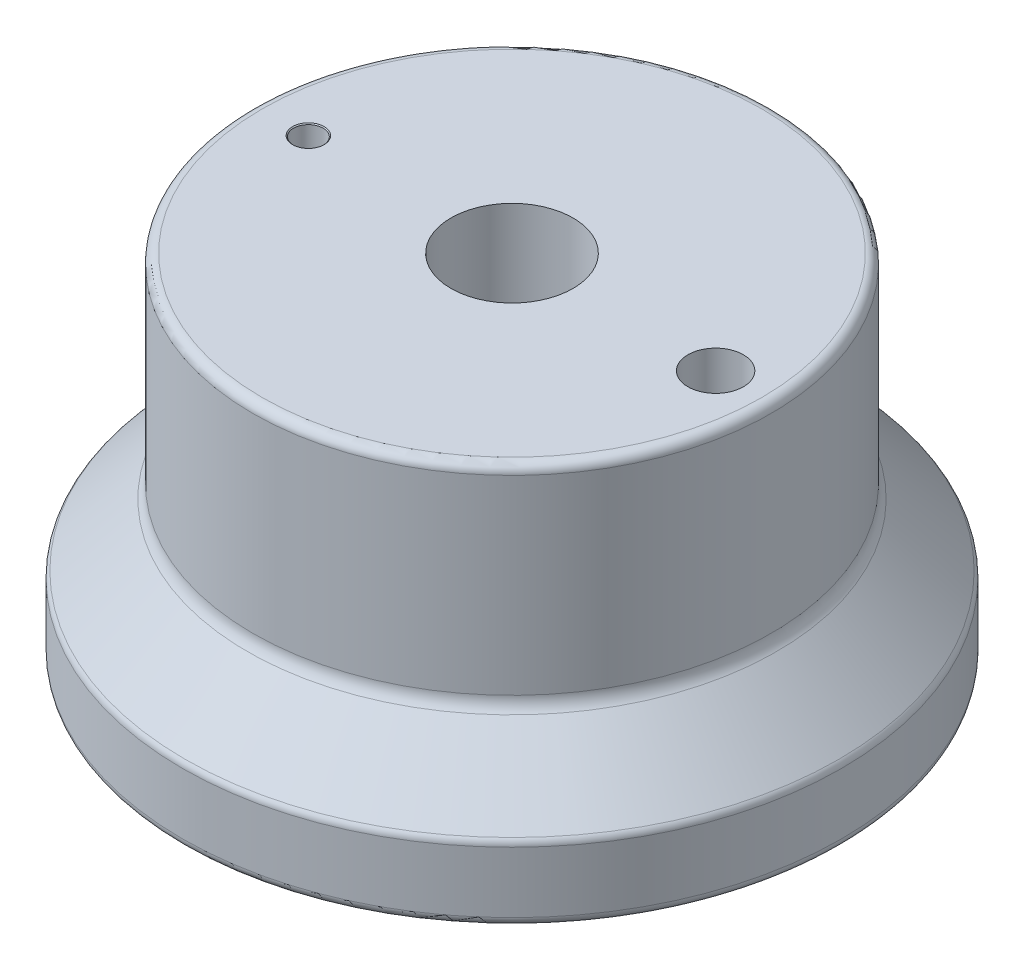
ISO-10303-21;
HEADER;
FILE_DESCRIPTION(('STEP AP214'),'2;1');
FILE_NAME('part.step','',(''),(''),'','','');
FILE_SCHEMA(('AUTOMOTIVE_DESIGN { 1 0 10303 214 1 1 1 1 }'));
ENDSEC;
DATA;
#1=APPLICATION_CONTEXT('core data for automotive mechanical design processes');
#2=APPLICATION_PROTOCOL_DEFINITION('international standard','automotive_design',2000,#1);
#3=PRODUCT_CONTEXT('',#1,'mechanical');
#4=PRODUCT('Part','Part','',(#3));
#5=PRODUCT_RELATED_PRODUCT_CATEGORY('part','',(#4));
#6=PRODUCT_DEFINITION_FORMATION('','',#4);
#7=PRODUCT_DEFINITION_CONTEXT('part definition',#1,'design');
#8=PRODUCT_DEFINITION('design','',#6,#7);
#9=PRODUCT_DEFINITION_SHAPE('','',#8);
#10=(LENGTH_UNIT() NAMED_UNIT(*) SI_UNIT(.MILLI.,.METRE.));
#11=(NAMED_UNIT(*) PLANE_ANGLE_UNIT() SI_UNIT($,.RADIAN.));
#12=(NAMED_UNIT(*) SI_UNIT($,.STERADIAN.) SOLID_ANGLE_UNIT());
#13=UNCERTAINTY_MEASURE_WITH_UNIT(LENGTH_MEASURE(1.E-05),#10,'distance_accuracy_value','');
#14=(GEOMETRIC_REPRESENTATION_CONTEXT(3) GLOBAL_UNCERTAINTY_ASSIGNED_CONTEXT((#13)) GLOBAL_UNIT_ASSIGNED_CONTEXT((#10,
#11,#12)) REPRESENTATION_CONTEXT('',''));
#15=CARTESIAN_POINT('',(0.,0.,0.));
#16=DIRECTION('',(0.,0.,1.));
#17=DIRECTION('',(1.,0.,0.));
#18=AXIS2_PLACEMENT_3D('',#15,#16,#17);
#19=CARTESIAN_POINT('',(8.9,0.,0.));
#20=DIRECTION('',(0.,-1.,0.));
#21=DIRECTION('',(0.,0.,-1.));
#22=AXIS2_PLACEMENT_3D('',#19,#20,#21);
#23=PLANE('',#22);
#24=CARTESIAN_POINT('',(0.,0.,0.));
#25=DIRECTION('',(0.,-1.,0.));
#26=DIRECTION('',(0.,0.,-1.));
#27=AXIS2_PLACEMENT_3D('',#24,#25,#26);
#28=CIRCLE('',#27,8.65);
#29=CARTESIAN_POINT('',(0.,0.,-8.65));
#30=VERTEX_POINT('',#29);
#31=EDGE_CURVE('E81',#30,#30,#28,.T.);
#32=ORIENTED_EDGE('',*,*,#31,.T.);
#33=EDGE_LOOP('',(#32));
#34=FACE_BOUND('',#33,.T.);
#35=CARTESIAN_POINT('',(-5.5,0.,0.));
#36=DIRECTION('',(0.,-1.,0.));
#37=DIRECTION('',(0.,0.,-1.));
#38=AXIS2_PLACEMENT_3D('',#35,#36,#37);
#39=CIRCLE('',#38,0.425);
#40=CARTESIAN_POINT('',(-5.5,0.,-0.425000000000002));
#41=VERTEX_POINT('',#40);
#42=EDGE_CURVE('E72',#41,#41,#39,.T.);
#43=ORIENTED_EDGE('',*,*,#42,.F.);
#44=EDGE_LOOP('',(#43));
#45=FACE_BOUND('',#44,.T.);
#46=ADVANCED_FACE('F35',(#34,#45),#23,.T.);
#47=CARTESIAN_POINT('',(0.,9.5,0.));
#48=DIRECTION('',(0.,1.,0.));
#49=DIRECTION('',(0.,0.,1.));
#50=AXIS2_PLACEMENT_3D('',#47,#48,#49);
#51=PLANE('',#50);
#52=CARTESIAN_POINT('',(5.5,9.5,0.));
#53=DIRECTION('',(0.,1.,0.));
#54=DIRECTION('',(0.,0.,1.));
#55=AXIS2_PLACEMENT_3D('',#52,#53,#54);
#56=CIRCLE('',#55,0.75);
#57=CARTESIAN_POINT('',(5.5,9.5,0.75));
#58=VERTEX_POINT('',#57);
#59=EDGE_CURVE('E59',#58,#58,#56,.T.);
#60=ORIENTED_EDGE('',*,*,#59,.F.);
#61=EDGE_LOOP('',(#60));
#62=FACE_BOUND('',#61,.T.);
#63=CARTESIAN_POINT('',(0.,9.5,0.));
#64=DIRECTION('',(0.,1.,0.));
#65=DIRECTION('',(0.,0.,1.));
#66=AXIS2_PLACEMENT_3D('',#63,#64,#65);
#67=CIRCLE('',#66,6.75);
#68=CARTESIAN_POINT('',(0.,9.5,6.75));
#69=VERTEX_POINT('',#68);
#70=EDGE_CURVE('E96',#69,#69,#67,.T.);
#71=ORIENTED_EDGE('',*,*,#70,.T.);
#72=EDGE_LOOP('',(#71));
#73=FACE_BOUND('',#72,.T.);
#74=CARTESIAN_POINT('',(0.,9.5,0.));
#75=DIRECTION('',(0.,1.,0.));
#76=DIRECTION('',(0.,0.,1.));
#77=AXIS2_PLACEMENT_3D('',#74,#75,#76);
#78=CIRCLE('',#77,1.65);
#79=CARTESIAN_POINT('',(0.,9.5,1.65));
#80=VERTEX_POINT('',#79);
#81=EDGE_CURVE('E58',#80,#80,#78,.T.);
#82=ORIENTED_EDGE('',*,*,#81,.F.);
#83=EDGE_LOOP('',(#82));
#84=FACE_BOUND('',#83,.T.);
#85=CARTESIAN_POINT('',(-5.5,9.5,0.));
#86=DIRECTION('',(0.,-1.,0.));
#87=DIRECTION('',(0.,0.,-1.));
#88=AXIS2_PLACEMENT_3D('',#85,#86,#87);
#89=CIRCLE('',#88,0.424999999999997);
#90=CARTESIAN_POINT('',(-5.5,9.5,-0.424999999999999));
#91=VERTEX_POINT('',#90);
#92=EDGE_CURVE('E69',#91,#91,#89,.T.);
#93=ORIENTED_EDGE('',*,*,#92,.T.);
#94=EDGE_LOOP('',(#93));
#95=FACE_BOUND('',#94,.T.);
#96=ADVANCED_FACE('F114',(#62,#73,#84,#95),#51,.T.);
#97=CARTESIAN_POINT('',(0.,0.,0.));
#98=DIRECTION('',(0.,-1.,0.));
#99=DIRECTION('',(0.,0.,-1.));
#100=AXIS2_PLACEMENT_3D('',#97,#98,#99);
#101=CYLINDRICAL_SURFACE('',#100,7.);
#102=CARTESIAN_POINT('',(0.,4.10710678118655,0.));
#103=DIRECTION('',(0.,-1.,0.));
#104=DIRECTION('',(0.,0.,-1.));
#105=AXIS2_PLACEMENT_3D('',#102,#103,#104);
#106=CIRCLE('',#105,7.);
#107=CARTESIAN_POINT('',(0.,4.10710678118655,-7.));
#108=VERTEX_POINT('',#107);
#109=EDGE_CURVE('E11',#108,#108,#106,.F.);
#110=ORIENTED_EDGE('',*,*,#109,.T.);
#111=EDGE_LOOP('',(#110));
#112=FACE_BOUND('',#111,.T.);
#113=CARTESIAN_POINT('',(0.,9.25,0.));
#114=DIRECTION('',(0.,1.,0.));
#115=DIRECTION('',(0.,0.,1.));
#116=AXIS2_PLACEMENT_3D('',#113,#114,#115);
#117=CIRCLE('',#116,7.);
#118=CARTESIAN_POINT('',(0.,9.25,7.));
#119=VERTEX_POINT('',#118);
#120=EDGE_CURVE('E93',#119,#119,#117,.F.);
#121=ORIENTED_EDGE('',*,*,#120,.T.);
#122=EDGE_LOOP('',(#121));
#123=FACE_BOUND('',#122,.T.);
#124=ADVANCED_FACE('F120',(#112,#123),#101,.T.);
#125=CARTESIAN_POINT('',(0.,2.,0.));
#126=DIRECTION('',(0.,-1.,0.));
#127=DIRECTION('',(0.,0.,-1.));
#128=AXIS2_PLACEMENT_3D('',#125,#126,#127);
#129=CONICAL_SURFACE('',#128,8.9,0.785398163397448);
#130=CARTESIAN_POINT('',(0.,3.75355339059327,0.));
#131=DIRECTION('',(0.,-1.,0.));
#132=DIRECTION('',(0.,0.,-1.));
#133=AXIS2_PLACEMENT_3D('',#130,#131,#132);
#134=CIRCLE('',#133,7.14644660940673);
#135=CARTESIAN_POINT('',(0.,3.75355339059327,-7.14644660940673));
#136=VERTEX_POINT('',#135);
#137=EDGE_CURVE('E43',#136,#136,#134,.T.);
#138=ORIENTED_EDGE('',*,*,#137,.T.);
#139=EDGE_LOOP('',(#138));
#140=FACE_BOUND('',#139,.T.);
#141=CARTESIAN_POINT('',(0.,2.07322330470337,0.));
#142=DIRECTION('',(0.,1.,0.));
#143=DIRECTION('',(0.,0.,1.));
#144=AXIS2_PLACEMENT_3D('',#141,#142,#143);
#145=CIRCLE('',#144,8.82677669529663);
#146=CARTESIAN_POINT('',(0.,2.07322330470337,8.82677669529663));
#147=VERTEX_POINT('',#146);
#148=EDGE_CURVE('E90',#147,#147,#145,.T.);
#149=ORIENTED_EDGE('',*,*,#148,.T.);
#150=EDGE_LOOP('',(#149));
#151=FACE_BOUND('',#150,.T.);
#152=ADVANCED_FACE('F101',(#140,#151),#129,.T.);
#153=CARTESIAN_POINT('',(0.,0.,0.));
#154=DIRECTION('',(0.,-1.,0.));
#155=DIRECTION('',(0.,0.,-1.));
#156=AXIS2_PLACEMENT_3D('',#153,#154,#155);
#157=CYLINDRICAL_SURFACE('',#156,8.9);
#158=CARTESIAN_POINT('',(0.,0.25,0.));
#159=DIRECTION('',(0.,-1.,0.));
#160=DIRECTION('',(0.,0.,-1.));
#161=AXIS2_PLACEMENT_3D('',#158,#159,#160);
#162=CIRCLE('',#161,8.9);
#163=CARTESIAN_POINT('',(0.,0.25,-8.9));
#164=VERTEX_POINT('',#163);
#165=EDGE_CURVE('E87',#164,#164,#162,.F.);
#166=ORIENTED_EDGE('',*,*,#165,.T.);
#167=EDGE_LOOP('',(#166));
#168=FACE_BOUND('',#167,.T.);
#169=CARTESIAN_POINT('',(0.,1.89644660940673,0.));
#170=DIRECTION('',(0.,1.,0.));
#171=DIRECTION('',(0.,0.,1.));
#172=AXIS2_PLACEMENT_3D('',#169,#170,#171);
#173=CIRCLE('',#172,8.9);
#174=CARTESIAN_POINT('',(0.,1.89644660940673,8.9));
#175=VERTEX_POINT('',#174);
#176=EDGE_CURVE('E84',#175,#175,#173,.F.);
#177=ORIENTED_EDGE('',*,*,#176,.T.);
#178=EDGE_LOOP('',(#177));
#179=FACE_BOUND('',#178,.T.);
#180=ADVANCED_FACE('F139',(#168,#179),#157,.T.);
#181=CARTESIAN_POINT('',(-5.5,9.475,0.));
#182=DIRECTION('',(0.,1.,0.));
#183=DIRECTION('',(0.,0.,1.));
#184=AXIS2_PLACEMENT_3D('',#181,#182,#183);
#185=CONICAL_SURFACE('',#184,0.399999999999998,0.785398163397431);
#186=ORIENTED_EDGE('',*,*,#92,.F.);
#187=EDGE_LOOP('',(#186));
#188=FACE_BOUND('',#187,.T.);
#189=CARTESIAN_POINT('',(-5.5,9.475,0.));
#190=DIRECTION('',(0.,-1.,0.));
#191=DIRECTION('',(0.,0.,-1.));
#192=AXIS2_PLACEMENT_3D('',#189,#190,#191);
#193=CIRCLE('',#192,0.399999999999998);
#194=CARTESIAN_POINT('',(-5.5,9.475,-0.399999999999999));
#195=VERTEX_POINT('',#194);
#196=EDGE_CURVE('E78',#195,#195,#193,.T.);
#197=ORIENTED_EDGE('',*,*,#196,.T.);
#198=EDGE_LOOP('',(#197));
#199=FACE_BOUND('',#198,.T.);
#200=ADVANCED_FACE('F141',(#188,#199),#185,.F.);
#201=CARTESIAN_POINT('',(-5.5,0.,0.));
#202=DIRECTION('',(0.,-1.,0.));
#203=DIRECTION('',(0.,0.,-1.));
#204=AXIS2_PLACEMENT_3D('',#201,#202,#203);
#205=CYLINDRICAL_SURFACE('',#204,0.399999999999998);
#206=ORIENTED_EDGE('',*,*,#196,.F.);
#207=EDGE_LOOP('',(#206));
#208=FACE_BOUND('',#207,.T.);
#209=CARTESIAN_POINT('',(-5.5,0.0144337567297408,0.));
#210=DIRECTION('',(0.,-1.,0.));
#211=DIRECTION('',(0.,0.,-1.));
#212=AXIS2_PLACEMENT_3D('',#209,#210,#211);
#213=CIRCLE('',#212,0.399999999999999);
#214=CARTESIAN_POINT('',(-5.5,0.0144337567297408,-0.400000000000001));
#215=VERTEX_POINT('',#214);
#216=EDGE_CURVE('E75',#215,#215,#213,.T.);
#217=ORIENTED_EDGE('',*,*,#216,.T.);
#218=EDGE_LOOP('',(#217));
#219=FACE_BOUND('',#218,.T.);
#220=ADVANCED_FACE('F148',(#208,#219),#205,.F.);
#221=CARTESIAN_POINT('',(-5.5,0.,0.));
#222=DIRECTION('',(0.,-1.,0.));
#223=DIRECTION('',(0.,0.,-1.));
#224=AXIS2_PLACEMENT_3D('',#221,#222,#223);
#225=CONICAL_SURFACE('',#224,0.425,1.0471975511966);
#226=ORIENTED_EDGE('',*,*,#216,.F.);
#227=EDGE_LOOP('',(#226));
#228=FACE_BOUND('',#227,.T.);
#229=ORIENTED_EDGE('',*,*,#42,.T.);
#230=EDGE_LOOP('',(#229));
#231=FACE_BOUND('',#230,.T.);
#232=ADVANCED_FACE('F204',(#228,#231),#225,.F.);
#233=CARTESIAN_POINT('',(0.,3.5,0.));
#234=DIRECTION('',(0.,1.,0.));
#235=DIRECTION('',(0.,0.,1.));
#236=AXIS2_PLACEMENT_3D('',#233,#234,#235);
#237=CONICAL_SURFACE('',#236,1.65,1.02974425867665);
#238=CARTESIAN_POINT('',(0.,2.50857997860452,0.));
#239=VERTEX_POINT('',#238);
#240=VERTEX_LOOP('',#239);
#241=FACE_BOUND('',#240,.T.);
#242=CARTESIAN_POINT('',(0.,3.5,0.));
#243=DIRECTION('',(0.,1.,0.));
#244=DIRECTION('',(0.,0.,1.));
#245=AXIS2_PLACEMENT_3D('',#242,#243,#244);
#246=CIRCLE('',#245,1.65);
#247=CARTESIAN_POINT('',(0.,3.5,1.65));
#248=VERTEX_POINT('',#247);
#249=EDGE_CURVE('E62',#248,#248,#246,.T.);
#250=ORIENTED_EDGE('',*,*,#249,.T.);
#251=EDGE_LOOP('',(#250));
#252=FACE_BOUND('',#251,.T.);
#253=ADVANCED_FACE('F200',(#241,#252),#237,.F.);
#254=CARTESIAN_POINT('',(0.,9.5,0.));
#255=DIRECTION('',(0.,1.,0.));
#256=DIRECTION('',(0.,0.,1.));
#257=AXIS2_PLACEMENT_3D('',#254,#255,#256);
#258=CYLINDRICAL_SURFACE('',#257,1.65);
#259=ORIENTED_EDGE('',*,*,#249,.F.);
#260=EDGE_LOOP('',(#259));
#261=FACE_BOUND('',#260,.T.);
#262=ORIENTED_EDGE('',*,*,#81,.T.);
#263=EDGE_LOOP('',(#262));
#264=FACE_BOUND('',#263,.T.);
#265=ADVANCED_FACE('F129',(#261,#264),#258,.F.);
#266=CARTESIAN_POINT('',(0.,0.25,0.));
#267=DIRECTION('',(0.,-1.,0.));
#268=DIRECTION('',(0.,0.,-1.));
#269=AXIS2_PLACEMENT_3D('',#266,#267,#268);
#270=TOROIDAL_SURFACE('',#269,8.65,0.25);
#271=ORIENTED_EDGE('',*,*,#165,.F.);
#272=EDGE_LOOP('',(#271));
#273=FACE_BOUND('',#272,.T.);
#274=ORIENTED_EDGE('',*,*,#31,.F.);
#275=EDGE_LOOP('',(#274));
#276=FACE_BOUND('',#275,.T.);
#277=ADVANCED_FACE('F126',(#273,#276),#270,.T.);
#278=CARTESIAN_POINT('',(0.,1.89644660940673,0.));
#279=DIRECTION('',(0.,1.,0.));
#280=DIRECTION('',(0.,0.,1.));
#281=AXIS2_PLACEMENT_3D('',#278,#279,#280);
#282=TOROIDAL_SURFACE('',#281,8.65,0.25);
#283=ORIENTED_EDGE('',*,*,#148,.F.);
#284=EDGE_LOOP('',(#283));
#285=FACE_BOUND('',#284,.T.);
#286=ORIENTED_EDGE('',*,*,#176,.F.);
#287=EDGE_LOOP('',(#286));
#288=FACE_BOUND('',#287,.T.);
#289=ADVANCED_FACE('F110',(#285,#288),#282,.T.);
#290=CARTESIAN_POINT('',(0.,9.25,0.));
#291=DIRECTION('',(0.,1.,0.));
#292=DIRECTION('',(0.,0.,1.));
#293=AXIS2_PLACEMENT_3D('',#290,#291,#292);
#294=TOROIDAL_SURFACE('',#293,6.75,0.25);
#295=ORIENTED_EDGE('',*,*,#70,.F.);
#296=EDGE_LOOP('',(#295));
#297=FACE_BOUND('',#296,.T.);
#298=ORIENTED_EDGE('',*,*,#120,.F.);
#299=EDGE_LOOP('',(#298));
#300=FACE_BOUND('',#299,.T.);
#301=ADVANCED_FACE('F105',(#297,#300),#294,.T.);
#302=CARTESIAN_POINT('',(0.,4.10710678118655,0.));
#303=DIRECTION('',(0.,-1.,0.));
#304=DIRECTION('',(0.,0.,-1.));
#305=AXIS2_PLACEMENT_3D('',#302,#303,#304);
#306=TOROIDAL_SURFACE('',#305,7.5,0.5);
#307=ORIENTED_EDGE('',*,*,#109,.F.);
#308=EDGE_LOOP('',(#307));
#309=FACE_BOUND('',#308,.T.);
#310=ORIENTED_EDGE('',*,*,#137,.F.);
#311=EDGE_LOOP('',(#310));
#312=FACE_BOUND('',#311,.T.);
#313=ADVANCED_FACE('F37',(#309,#312),#306,.F.);
#314=CARTESIAN_POINT('',(5.5,6.,0.));
#315=DIRECTION('',(0.,1.,0.));
#316=DIRECTION('',(0.,0.,1.));
#317=AXIS2_PLACEMENT_3D('',#314,#315,#316);
#318=CONICAL_SURFACE('',#317,0.749999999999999,0.785398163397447);
#319=CARTESIAN_POINT('',(5.5,5.25,0.));
#320=VERTEX_POINT('',#319);
#321=VERTEX_LOOP('',#320);
#322=FACE_BOUND('',#321,.T.);
#323=CARTESIAN_POINT('',(5.5,6.,0.));
#324=DIRECTION('',(0.,1.,0.));
#325=DIRECTION('',(0.,0.,1.));
#326=AXIS2_PLACEMENT_3D('',#323,#324,#325);
#327=CIRCLE('',#326,0.749999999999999);
#328=CARTESIAN_POINT('',(5.5,6.,0.749999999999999));
#329=VERTEX_POINT('',#328);
#330=EDGE_CURVE('E56',#329,#329,#327,.T.);
#331=ORIENTED_EDGE('',*,*,#330,.T.);
#332=EDGE_LOOP('',(#331));
#333=FACE_BOUND('',#332,.T.);
#334=ADVANCED_FACE('F49',(#322,#333),#318,.F.);
#335=CARTESIAN_POINT('',(5.5,9.5,0.));
#336=DIRECTION('',(0.,1.,0.));
#337=DIRECTION('',(0.,0.,1.));
#338=AXIS2_PLACEMENT_3D('',#335,#336,#337);
#339=CYLINDRICAL_SURFACE('',#338,0.749999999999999);
#340=ORIENTED_EDGE('',*,*,#330,.F.);
#341=EDGE_LOOP('',(#340));
#342=FACE_BOUND('',#341,.T.);
#343=ORIENTED_EDGE('',*,*,#59,.T.);
#344=EDGE_LOOP('',(#343));
#345=FACE_BOUND('',#344,.T.);
#346=ADVANCED_FACE('F52',(#342,#345),#339,.F.);
#347=CLOSED_SHELL('',(#46,#96,#124,#152,#180,#200,#220,#232,#253,#265,#277,#289,#301,#313,#334,#346));
#348=MANIFOLD_SOLID_BREP('B2',#347);
#349=ADVANCED_BREP_SHAPE_REPRESENTATION('',(#18,#348),#14);
#350=SHAPE_DEFINITION_REPRESENTATION(#9,#349);
ENDSEC;
END-ISO-10303-21;
